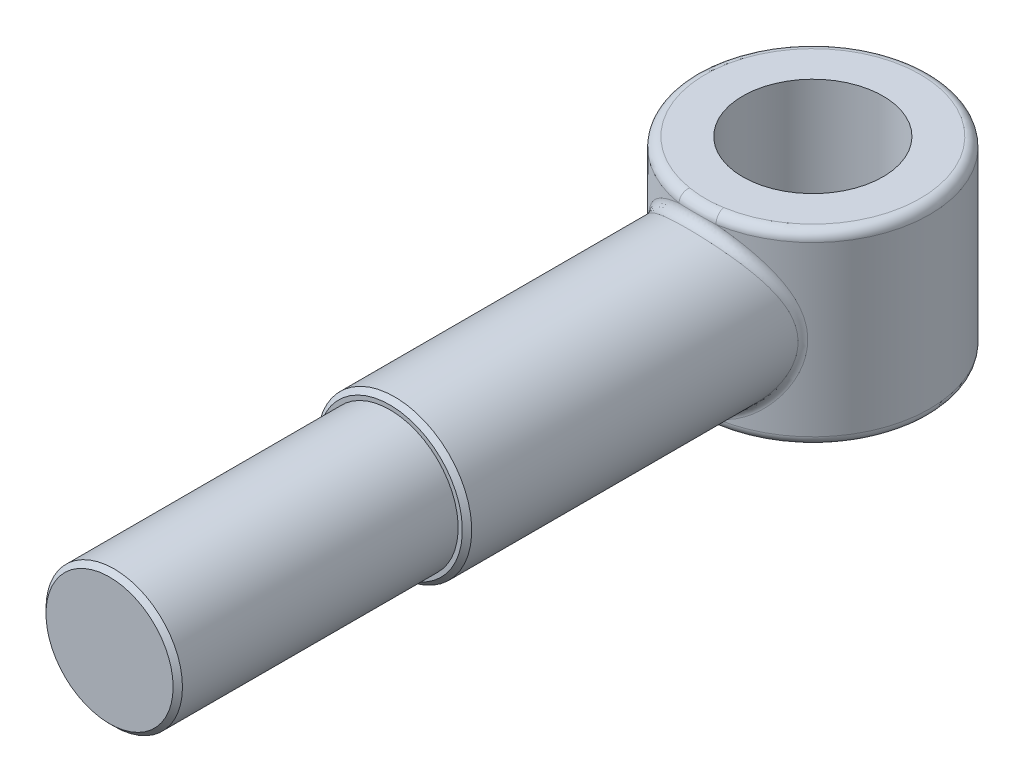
from build123d import *

# Parameters (mm, degrees)
ESQUISSE1_R             = 14.6
BASE_EXTRUSION_DEPTH    = 60
ESQUISSE2_R             = 16.5
BOSS_EXTRU_1_DEPTH      = 75
ESQUISSE3_R             = 25
BOSS_EXTRU_2_DEPTH      = 20
ESQUISSE4_R             = 15
ENL_V_MAT_EXTRU_1_DEPTH = 125.760771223
CONG_1_R                = 2
CHANFREIN2_SIZE         = 1
CONG_2_R                = 2


with BuildPart() as part:
    # Esquisse1 → Base-Extrusion (new body)
    with BuildSketch(Plane.XY):
        Circle(ESQUISSE1_R)
    extrude(amount=BASE_EXTRUSION_DEPTH)

    # Esquisse2 → Boss.-Extru.1 (add)
    with BuildSketch(Plane(origin=(0, 0, 0), x_dir=(-1, 0, 0), z_dir=(0, 0, -1))):
        Circle(ESQUISSE2_R)
    extrude(amount=BOSS_EXTRU_1_DEPTH)

    # Esquisse3 → Boss.-Extru.2 (add, symmetric)
    with BuildSketch(Plane(origin=(0, 0, 0), x_dir=(1, 0, 0), z_dir=(0, 1, 0))):
        with Locations(Location((0, 90.5, 0), (0, 0, 270))):
            Circle(ESQUISSE3_R)
    extrude(amount=BOSS_EXTRU_2_DEPTH, both=True)

    # Esquisse4 → Enl_v. mat.-Extru.1 (cut, through all)
    with BuildSketch(Plane(origin=(0, 20, 0), x_dir=(-1, 0, 0), z_dir=(0, 1, 0))):
        with Locations(Location((0, -90.5, 0), (0, 0, 90))):
            Circle(ESQUISSE4_R)
    extrude(amount=-ENL_V_MAT_EXTRU_1_DEPTH, mode=Mode.SUBTRACT)

    # Cong_1
    cong_1_edges = [part.edges().sort_by_distance(p)[0] for p in [
        (-11.702229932, 11.632188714, -68.407969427),
    ]]
    fillet(cong_1_edges, radius=CONG_1_R)

    # Chanfrein2
    chanfrein2_edges = [part.edges().sort_by_distance(p)[0] for p in [
        (-14.6, 0, 60),
        (16.5, 0, 0),
    ]]
    chamfer(chanfrein2_edges, length=CHANFREIN2_SIZE)

    # Cong_2
    cong_2_edges = [part.edges().sort_by_distance(p)[0] for p in [
        (-12.363537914, 12.805280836, -68.771150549),
        (0, -20, -115.5),
        (0, 20, -115.5),
    ]]
    fillet(cong_2_edges, radius=CONG_2_R)


solid = part.part
